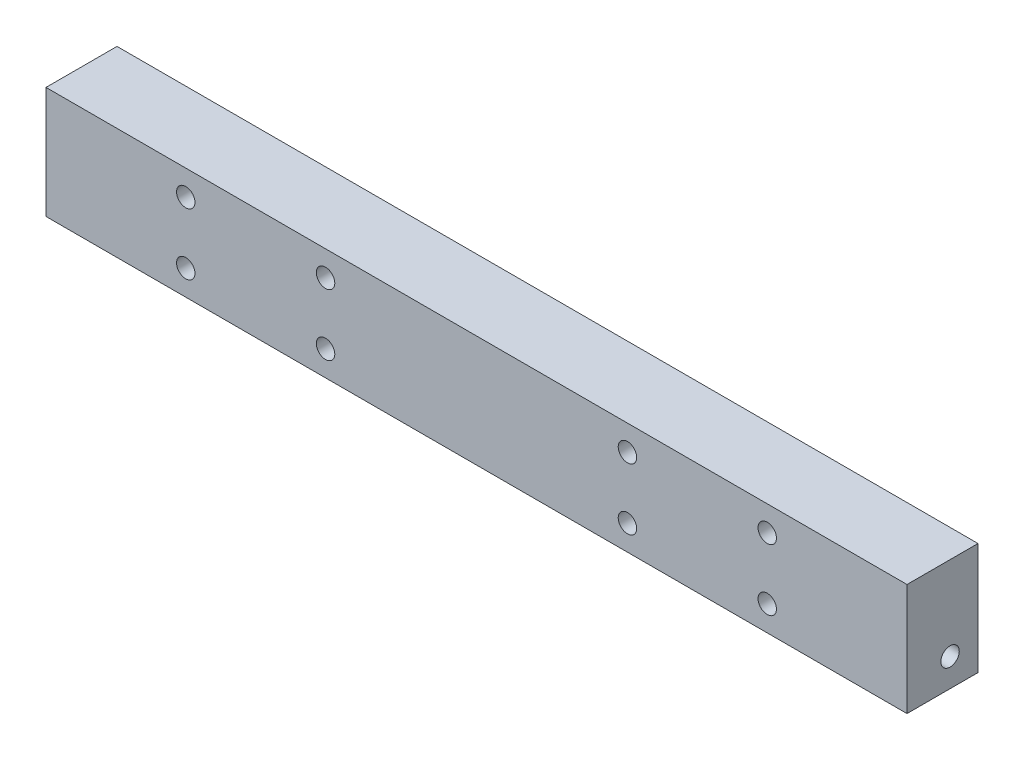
ISO-10303-21;
HEADER;
FILE_DESCRIPTION(('STEP AP214'),'2;1');
FILE_NAME('part.step','',(''),(''),'','','');
FILE_SCHEMA(('AUTOMOTIVE_DESIGN { 1 0 10303 214 1 1 1 1 }'));
ENDSEC;
DATA;
#1=APPLICATION_CONTEXT('core data for automotive mechanical design processes');
#2=APPLICATION_PROTOCOL_DEFINITION('international standard','automotive_design',2000,#1);
#3=PRODUCT_CONTEXT('',#1,'mechanical');
#4=PRODUCT('Part','Part','',(#3));
#5=PRODUCT_RELATED_PRODUCT_CATEGORY('part','',(#4));
#6=PRODUCT_DEFINITION_FORMATION('','',#4);
#7=PRODUCT_DEFINITION_CONTEXT('part definition',#1,'design');
#8=PRODUCT_DEFINITION('design','',#6,#7);
#9=PRODUCT_DEFINITION_SHAPE('','',#8);
#10=(LENGTH_UNIT() NAMED_UNIT(*) SI_UNIT(.MILLI.,.METRE.));
#11=(NAMED_UNIT(*) PLANE_ANGLE_UNIT() SI_UNIT($,.RADIAN.));
#12=(NAMED_UNIT(*) SI_UNIT($,.STERADIAN.) SOLID_ANGLE_UNIT());
#13=UNCERTAINTY_MEASURE_WITH_UNIT(LENGTH_MEASURE(1.E-05),#10,'distance_accuracy_value','');
#14=(GEOMETRIC_REPRESENTATION_CONTEXT(3) GLOBAL_UNCERTAINTY_ASSIGNED_CONTEXT((#13)) GLOBAL_UNIT_ASSIGNED_CONTEXT((#10,
#11,#12)) REPRESENTATION_CONTEXT('',''));
#15=CARTESIAN_POINT('',(0.,0.,0.));
#16=DIRECTION('',(0.,0.,1.));
#17=DIRECTION('',(1.,0.,0.));
#18=AXIS2_PLACEMENT_3D('',#15,#16,#17);
#19=CARTESIAN_POINT('',(77.,10.,12.7));
#20=DIRECTION('',(-1.,0.,0.));
#21=DIRECTION('',(0.,0.,1.));
#22=AXIS2_PLACEMENT_3D('',#19,#20,#21);
#23=PLANE('',#22);
#24=CARTESIAN_POINT('',(77.,-5.,5.));
#25=DIRECTION('',(1.,0.,0.));
#26=DIRECTION('',(0.,1.,0.));
#27=AXIS2_PLACEMENT_3D('',#24,#25,#26);
#28=CIRCLE('',#27,1.64999999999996);
#29=CARTESIAN_POINT('',(77.,-3.35000000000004,5.));
#30=VERTEX_POINT('',#29);
#31=EDGE_CURVE('E114',#30,#30,#28,.T.);
#32=ORIENTED_EDGE('',*,*,#31,.F.);
#33=EDGE_LOOP('',(#32));
#34=FACE_BOUND('',#33,.T.);
#35=DIRECTION('',(0.,1.,0.));
#36=VECTOR('',#35,1.);
#37=CARTESIAN_POINT('',(77.,10.,0.));
#38=LINE('',#37,#36);
#39=CARTESIAN_POINT('',(77.,-10.,0.));
#40=VERTEX_POINT('',#39);
#41=CARTESIAN_POINT('',(77.,10.,0.));
#42=VERTEX_POINT('',#41);
#43=EDGE_CURVE('E100',#40,#42,#38,.T.);
#44=ORIENTED_EDGE('',*,*,#43,.T.);
#45=DIRECTION('',(0.,0.,-1.));
#46=VECTOR('',#45,1.);
#47=CARTESIAN_POINT('',(77.,10.,12.7));
#48=LINE('',#47,#46);
#49=CARTESIAN_POINT('',(77.,10.,12.7));
#50=VERTEX_POINT('',#49);
#51=EDGE_CURVE('E11',#50,#42,#48,.T.);
#52=ORIENTED_EDGE('',*,*,#51,.F.);
#53=DIRECTION('',(0.,1.,0.));
#54=VECTOR('',#53,1.);
#55=CARTESIAN_POINT('',(77.,10.,12.7));
#56=LINE('',#55,#54);
#57=CARTESIAN_POINT('',(77.,-10.,12.7));
#58=VERTEX_POINT('',#57);
#59=EDGE_CURVE('E88',#58,#50,#56,.T.);
#60=ORIENTED_EDGE('',*,*,#59,.F.);
#61=DIRECTION('',(0.,0.,-1.));
#62=VECTOR('',#61,1.);
#63=CARTESIAN_POINT('',(77.,-10.,12.7));
#64=LINE('',#63,#62);
#65=EDGE_CURVE('E96',#58,#40,#64,.T.);
#66=ORIENTED_EDGE('',*,*,#65,.T.);
#67=EDGE_LOOP('',(#44,#52,#60,#66));
#68=FACE_BOUND('',#67,.T.);
#69=ADVANCED_FACE('F37',(#34,#68),#23,.F.);
#70=CARTESIAN_POINT('',(-77.,10.,12.7));
#71=DIRECTION('',(0.,-1.,0.));
#72=DIRECTION('',(0.,0.,-1.));
#73=AXIS2_PLACEMENT_3D('',#70,#71,#72);
#74=PLANE('',#73);
#75=DIRECTION('',(-1.,0.,0.));
#76=VECTOR('',#75,1.);
#77=CARTESIAN_POINT('',(-77.,10.,0.));
#78=LINE('',#77,#76);
#79=CARTESIAN_POINT('',(-77.,10.,0.));
#80=VERTEX_POINT('',#79);
#81=EDGE_CURVE('E92',#42,#80,#78,.T.);
#82=ORIENTED_EDGE('',*,*,#81,.T.);
#83=DIRECTION('',(0.,0.,-1.));
#84=VECTOR('',#83,1.);
#85=CARTESIAN_POINT('',(-77.,10.,12.7));
#86=LINE('',#85,#84);
#87=CARTESIAN_POINT('',(-77.,10.,12.7));
#88=VERTEX_POINT('',#87);
#89=EDGE_CURVE('E45',#88,#80,#86,.T.);
#90=ORIENTED_EDGE('',*,*,#89,.F.);
#91=DIRECTION('',(-1.,0.,0.));
#92=VECTOR('',#91,1.);
#93=CARTESIAN_POINT('',(-77.,10.,12.7));
#94=LINE('',#93,#92);
#95=EDGE_CURVE('E83',#50,#88,#94,.T.);
#96=ORIENTED_EDGE('',*,*,#95,.F.);
#97=ORIENTED_EDGE('',*,*,#51,.T.);
#98=EDGE_LOOP('',(#82,#90,#96,#97));
#99=FACE_BOUND('',#98,.T.);
#100=ADVANCED_FACE('F91',(#99),#74,.F.);
#101=CARTESIAN_POINT('',(-77.,10.,12.7));
#102=DIRECTION('',(1.,0.,0.));
#103=DIRECTION('',(0.,0.,-1.));
#104=AXIS2_PLACEMENT_3D('',#101,#102,#103);
#105=PLANE('',#104);
#106=CARTESIAN_POINT('',(-77.,-5.,5.));
#107=DIRECTION('',(1.,0.,0.));
#108=DIRECTION('',(0.,1.,0.));
#109=AXIS2_PLACEMENT_3D('',#106,#107,#108);
#110=CIRCLE('',#109,1.64999999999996);
#111=CARTESIAN_POINT('',(-77.,-3.35000000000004,5.));
#112=VERTEX_POINT('',#111);
#113=EDGE_CURVE('E144',#112,#112,#110,.T.);
#114=ORIENTED_EDGE('',*,*,#113,.T.);
#115=EDGE_LOOP('',(#114));
#116=FACE_BOUND('',#115,.T.);
#117=DIRECTION('',(0.,-1.,0.));
#118=VECTOR('',#117,1.);
#119=CARTESIAN_POINT('',(-77.,10.,0.));
#120=LINE('',#119,#118);
#121=CARTESIAN_POINT('',(-77.,-10.,0.));
#122=VERTEX_POINT('',#121);
#123=EDGE_CURVE('E70',#80,#122,#120,.T.);
#124=ORIENTED_EDGE('',*,*,#123,.T.);
#125=DIRECTION('',(0.,0.,-1.));
#126=VECTOR('',#125,1.);
#127=CARTESIAN_POINT('',(-77.,-10.,12.7));
#128=LINE('',#127,#126);
#129=CARTESIAN_POINT('',(-77.,-10.,12.7));
#130=VERTEX_POINT('',#129);
#131=EDGE_CURVE('E93',#130,#122,#128,.T.);
#132=ORIENTED_EDGE('',*,*,#131,.F.);
#133=DIRECTION('',(0.,-1.,0.));
#134=VECTOR('',#133,1.);
#135=CARTESIAN_POINT('',(-77.,10.,12.7));
#136=LINE('',#135,#134);
#137=EDGE_CURVE('E86',#88,#130,#136,.T.);
#138=ORIENTED_EDGE('',*,*,#137,.F.);
#139=ORIENTED_EDGE('',*,*,#89,.T.);
#140=EDGE_LOOP('',(#124,#132,#138,#139));
#141=FACE_BOUND('',#140,.T.);
#142=ADVANCED_FACE('F94',(#116,#141),#105,.F.);
#143=CARTESIAN_POINT('',(-77.,-10.,12.7));
#144=DIRECTION('',(0.,1.,0.));
#145=DIRECTION('',(0.,0.,1.));
#146=AXIS2_PLACEMENT_3D('',#143,#144,#145);
#147=PLANE('',#146);
#148=DIRECTION('',(1.,0.,0.));
#149=VECTOR('',#148,1.);
#150=CARTESIAN_POINT('',(-77.,-10.,0.));
#151=LINE('',#150,#149);
#152=EDGE_CURVE('E76',#122,#40,#151,.T.);
#153=ORIENTED_EDGE('',*,*,#152,.T.);
#154=ORIENTED_EDGE('',*,*,#65,.F.);
#155=DIRECTION('',(1.,0.,0.));
#156=VECTOR('',#155,1.);
#157=CARTESIAN_POINT('',(-77.,-10.,12.7));
#158=LINE('',#157,#156);
#159=EDGE_CURVE('E53',#130,#58,#158,.T.);
#160=ORIENTED_EDGE('',*,*,#159,.F.);
#161=ORIENTED_EDGE('',*,*,#131,.T.);
#162=EDGE_LOOP('',(#153,#154,#160,#161));
#163=FACE_BOUND('',#162,.T.);
#164=ADVANCED_FACE('F108',(#163),#147,.F.);
#165=CARTESIAN_POINT('',(0.,0.,12.7));
#166=DIRECTION('',(0.,0.,1.));
#167=DIRECTION('',(1.,0.,0.));
#168=AXIS2_PLACEMENT_3D('',#165,#166,#167);
#169=PLANE('',#168);
#170=CARTESIAN_POINT('',(-52.,-5.5,12.7));
#171=DIRECTION('',(0.,0.,-1.));
#172=DIRECTION('',(-1.,0.,0.));
#173=AXIS2_PLACEMENT_3D('',#170,#171,#172);
#174=CIRCLE('',#173,1.65);
#175=CARTESIAN_POINT('',(-53.65,-5.5,12.7));
#176=VERTEX_POINT('',#175);
#177=EDGE_CURVE('E163',#176,#176,#174,.T.);
#178=ORIENTED_EDGE('',*,*,#177,.T.);
#179=EDGE_LOOP('',(#178));
#180=FACE_BOUND('',#179,.T.);
#181=CARTESIAN_POINT('',(-27.,5.5,12.7));
#182=DIRECTION('',(0.,0.,-1.));
#183=DIRECTION('',(-1.,0.,0.));
#184=AXIS2_PLACEMENT_3D('',#181,#182,#183);
#185=CIRCLE('',#184,1.65);
#186=CARTESIAN_POINT('',(-28.65,5.5,12.7));
#187=VERTEX_POINT('',#186);
#188=EDGE_CURVE('E156',#187,#187,#185,.T.);
#189=ORIENTED_EDGE('',*,*,#188,.T.);
#190=EDGE_LOOP('',(#189));
#191=FACE_BOUND('',#190,.T.);
#192=CARTESIAN_POINT('',(-27.,-5.5,12.7));
#193=DIRECTION('',(0.,0.,-1.));
#194=DIRECTION('',(-1.,0.,0.));
#195=AXIS2_PLACEMENT_3D('',#192,#193,#194);
#196=CIRCLE('',#195,1.65);
#197=CARTESIAN_POINT('',(-28.65,-5.5,12.7));
#198=VERTEX_POINT('',#197);
#199=EDGE_CURVE('E168',#198,#198,#196,.T.);
#200=ORIENTED_EDGE('',*,*,#199,.T.);
#201=EDGE_LOOP('',(#200));
#202=FACE_BOUND('',#201,.T.);
#203=CARTESIAN_POINT('',(-52.,5.5,12.7));
#204=DIRECTION('',(0.,0.,-1.));
#205=DIRECTION('',(-1.,0.,0.));
#206=AXIS2_PLACEMENT_3D('',#203,#204,#205);
#207=CIRCLE('',#206,1.65);
#208=CARTESIAN_POINT('',(-53.65,5.5,12.7));
#209=VERTEX_POINT('',#208);
#210=EDGE_CURVE('E150',#209,#209,#207,.T.);
#211=ORIENTED_EDGE('',*,*,#210,.T.);
#212=EDGE_LOOP('',(#211));
#213=FACE_BOUND('',#212,.T.);
#214=CARTESIAN_POINT('',(52.,-5.5,12.7));
#215=DIRECTION('',(0.,0.,1.));
#216=DIRECTION('',(1.,0.,0.));
#217=AXIS2_PLACEMENT_3D('',#214,#215,#216);
#218=CIRCLE('',#217,1.65);
#219=CARTESIAN_POINT('',(53.65,-5.5,12.7));
#220=VERTEX_POINT('',#219);
#221=EDGE_CURVE('E133',#220,#220,#218,.T.);
#222=ORIENTED_EDGE('',*,*,#221,.F.);
#223=EDGE_LOOP('',(#222));
#224=FACE_BOUND('',#223,.T.);
#225=CARTESIAN_POINT('',(27.,5.5,12.7));
#226=DIRECTION('',(0.,0.,1.));
#227=DIRECTION('',(1.,0.,0.));
#228=AXIS2_PLACEMENT_3D('',#225,#226,#227);
#229=CIRCLE('',#228,1.65);
#230=CARTESIAN_POINT('',(28.65,5.5,12.7));
#231=VERTEX_POINT('',#230);
#232=EDGE_CURVE('E126',#231,#231,#229,.T.);
#233=ORIENTED_EDGE('',*,*,#232,.F.);
#234=EDGE_LOOP('',(#233));
#235=FACE_BOUND('',#234,.T.);
#236=CARTESIAN_POINT('',(27.,-5.5,12.7));
#237=DIRECTION('',(0.,0.,1.));
#238=DIRECTION('',(1.,0.,0.));
#239=AXIS2_PLACEMENT_3D('',#236,#237,#238);
#240=CIRCLE('',#239,1.65);
#241=CARTESIAN_POINT('',(28.65,-5.5,12.7));
#242=VERTEX_POINT('',#241);
#243=EDGE_CURVE('E138',#242,#242,#240,.T.);
#244=ORIENTED_EDGE('',*,*,#243,.F.);
#245=EDGE_LOOP('',(#244));
#246=FACE_BOUND('',#245,.T.);
#247=CARTESIAN_POINT('',(52.,5.5,12.7));
#248=DIRECTION('',(0.,0.,1.));
#249=DIRECTION('',(1.,0.,0.));
#250=AXIS2_PLACEMENT_3D('',#247,#248,#249);
#251=CIRCLE('',#250,1.65);
#252=CARTESIAN_POINT('',(53.65,5.5,12.7));
#253=VERTEX_POINT('',#252);
#254=EDGE_CURVE('E120',#253,#253,#251,.T.);
#255=ORIENTED_EDGE('',*,*,#254,.F.);
#256=EDGE_LOOP('',(#255));
#257=FACE_BOUND('',#256,.T.);
#258=ORIENTED_EDGE('',*,*,#59,.T.);
#259=ORIENTED_EDGE('',*,*,#95,.T.);
#260=ORIENTED_EDGE('',*,*,#137,.T.);
#261=ORIENTED_EDGE('',*,*,#159,.T.);
#262=EDGE_LOOP('',(#258,#259,#260,#261));
#263=FACE_BOUND('',#262,.T.);
#264=ADVANCED_FACE('F84',(#180,#191,#202,#213,#224,#235,#246,#257,#263),#169,.T.);
#265=CARTESIAN_POINT('',(0.,0.,0.));
#266=DIRECTION('',(0.,0.,1.));
#267=DIRECTION('',(1.,0.,0.));
#268=AXIS2_PLACEMENT_3D('',#265,#266,#267);
#269=PLANE('',#268);
#270=CARTESIAN_POINT('',(-52.,-5.5,0.));
#271=DIRECTION('',(0.,0.,-1.));
#272=DIRECTION('',(-1.,0.,0.));
#273=AXIS2_PLACEMENT_3D('',#270,#271,#272);
#274=CIRCLE('',#273,1.65);
#275=CARTESIAN_POINT('',(-53.65,-5.5,0.));
#276=VERTEX_POINT('',#275);
#277=EDGE_CURVE('E153',#276,#276,#274,.T.);
#278=ORIENTED_EDGE('',*,*,#277,.F.);
#279=EDGE_LOOP('',(#278));
#280=FACE_BOUND('',#279,.T.);
#281=CARTESIAN_POINT('',(-27.,5.5,0.));
#282=DIRECTION('',(0.,0.,-1.));
#283=DIRECTION('',(-1.,0.,0.));
#284=AXIS2_PLACEMENT_3D('',#281,#282,#283);
#285=CIRCLE('',#284,1.65);
#286=CARTESIAN_POINT('',(-28.65,5.5,0.));
#287=VERTEX_POINT('',#286);
#288=EDGE_CURVE('E159',#287,#287,#285,.T.);
#289=ORIENTED_EDGE('',*,*,#288,.F.);
#290=EDGE_LOOP('',(#289));
#291=FACE_BOUND('',#290,.T.);
#292=CARTESIAN_POINT('',(-27.,-5.5,0.));
#293=DIRECTION('',(0.,0.,-1.));
#294=DIRECTION('',(-1.,0.,0.));
#295=AXIS2_PLACEMENT_3D('',#292,#293,#294);
#296=CIRCLE('',#295,1.65);
#297=CARTESIAN_POINT('',(-28.65,-5.5,0.));
#298=VERTEX_POINT('',#297);
#299=EDGE_CURVE('E160',#298,#298,#296,.T.);
#300=ORIENTED_EDGE('',*,*,#299,.F.);
#301=EDGE_LOOP('',(#300));
#302=FACE_BOUND('',#301,.T.);
#303=CARTESIAN_POINT('',(-52.,5.5,0.));
#304=DIRECTION('',(0.,0.,-1.));
#305=DIRECTION('',(-1.,0.,0.));
#306=AXIS2_PLACEMENT_3D('',#303,#304,#305);
#307=CIRCLE('',#306,1.65);
#308=CARTESIAN_POINT('',(-53.65,5.5,0.));
#309=VERTEX_POINT('',#308);
#310=EDGE_CURVE('E147',#309,#309,#307,.T.);
#311=ORIENTED_EDGE('',*,*,#310,.F.);
#312=EDGE_LOOP('',(#311));
#313=FACE_BOUND('',#312,.T.);
#314=CARTESIAN_POINT('',(52.,-5.5,0.));
#315=DIRECTION('',(0.,0.,1.));
#316=DIRECTION('',(1.,0.,0.));
#317=AXIS2_PLACEMENT_3D('',#314,#315,#316);
#318=CIRCLE('',#317,1.65);
#319=CARTESIAN_POINT('',(53.65,-5.5,0.));
#320=VERTEX_POINT('',#319);
#321=EDGE_CURVE('E123',#320,#320,#318,.T.);
#322=ORIENTED_EDGE('',*,*,#321,.T.);
#323=EDGE_LOOP('',(#322));
#324=FACE_BOUND('',#323,.T.);
#325=CARTESIAN_POINT('',(27.,5.5,0.));
#326=DIRECTION('',(0.,0.,1.));
#327=DIRECTION('',(1.,0.,0.));
#328=AXIS2_PLACEMENT_3D('',#325,#326,#327);
#329=CIRCLE('',#328,1.65);
#330=CARTESIAN_POINT('',(28.65,5.5,0.));
#331=VERTEX_POINT('',#330);
#332=EDGE_CURVE('E129',#331,#331,#329,.T.);
#333=ORIENTED_EDGE('',*,*,#332,.T.);
#334=EDGE_LOOP('',(#333));
#335=FACE_BOUND('',#334,.T.);
#336=CARTESIAN_POINT('',(27.,-5.5,0.));
#337=DIRECTION('',(0.,0.,1.));
#338=DIRECTION('',(1.,0.,0.));
#339=AXIS2_PLACEMENT_3D('',#336,#337,#338);
#340=CIRCLE('',#339,1.65);
#341=CARTESIAN_POINT('',(28.65,-5.5,0.));
#342=VERTEX_POINT('',#341);
#343=EDGE_CURVE('E130',#342,#342,#340,.T.);
#344=ORIENTED_EDGE('',*,*,#343,.T.);
#345=EDGE_LOOP('',(#344));
#346=FACE_BOUND('',#345,.T.);
#347=CARTESIAN_POINT('',(52.,5.5,0.));
#348=DIRECTION('',(0.,0.,1.));
#349=DIRECTION('',(1.,0.,0.));
#350=AXIS2_PLACEMENT_3D('',#347,#348,#349);
#351=CIRCLE('',#350,1.65);
#352=CARTESIAN_POINT('',(53.65,5.5,0.));
#353=VERTEX_POINT('',#352);
#354=EDGE_CURVE('E117',#353,#353,#351,.T.);
#355=ORIENTED_EDGE('',*,*,#354,.T.);
#356=EDGE_LOOP('',(#355));
#357=FACE_BOUND('',#356,.T.);
#358=ORIENTED_EDGE('',*,*,#43,.F.);
#359=ORIENTED_EDGE('',*,*,#152,.F.);
#360=ORIENTED_EDGE('',*,*,#123,.F.);
#361=ORIENTED_EDGE('',*,*,#81,.F.);
#362=EDGE_LOOP('',(#358,#359,#360,#361));
#363=FACE_BOUND('',#362,.T.);
#364=ADVANCED_FACE('F111',(#280,#291,#302,#313,#324,#335,#346,#357,#363),#269,.F.);
#365=CARTESIAN_POINT('',(55.,-5.,5.));
#366=DIRECTION('',(1.,0.,0.));
#367=DIRECTION('',(0.,1.,0.));
#368=AXIS2_PLACEMENT_3D('',#365,#366,#367);
#369=CYLINDRICAL_SURFACE('',#368,1.64999999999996);
#370=CARTESIAN_POINT('',(55.,-5.,5.));
#371=DIRECTION('',(1.,0.,0.));
#372=DIRECTION('',(0.,1.,0.));
#373=AXIS2_PLACEMENT_3D('',#370,#371,#372);
#374=CIRCLE('',#373,1.64999999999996);
#375=CARTESIAN_POINT('',(55.,-3.35000000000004,5.));
#376=VERTEX_POINT('',#375);
#377=EDGE_CURVE('E103',#376,#376,#374,.T.);
#378=ORIENTED_EDGE('',*,*,#377,.F.);
#379=EDGE_LOOP('',(#378));
#380=FACE_BOUND('',#379,.T.);
#381=ORIENTED_EDGE('',*,*,#31,.T.);
#382=EDGE_LOOP('',(#381));
#383=FACE_BOUND('',#382,.T.);
#384=ADVANCED_FACE('F179',(#380,#383),#369,.F.);
#385=CARTESIAN_POINT('',(55.,-5.,5.));
#386=DIRECTION('',(1.,0.,0.));
#387=DIRECTION('',(0.,1.,0.));
#388=AXIS2_PLACEMENT_3D('',#385,#386,#387);
#389=PLANE('',#388);
#390=ORIENTED_EDGE('',*,*,#377,.T.);
#391=EDGE_LOOP('',(#390));
#392=FACE_BOUND('',#391,.T.);
#393=ADVANCED_FACE('F196',(#392),#389,.T.);
#394=CARTESIAN_POINT('',(52.,5.5,0.));
#395=DIRECTION('',(0.,0.,1.));
#396=DIRECTION('',(1.,0.,0.));
#397=AXIS2_PLACEMENT_3D('',#394,#395,#396);
#398=CYLINDRICAL_SURFACE('',#397,1.65);
#399=ORIENTED_EDGE('',*,*,#354,.F.);
#400=EDGE_LOOP('',(#399));
#401=FACE_BOUND('',#400,.T.);
#402=ORIENTED_EDGE('',*,*,#254,.T.);
#403=EDGE_LOOP('',(#402));
#404=FACE_BOUND('',#403,.T.);
#405=ADVANCED_FACE('F192',(#401,#404),#398,.F.);
#406=CARTESIAN_POINT('',(27.,-5.5,0.));
#407=DIRECTION('',(0.,0.,1.));
#408=DIRECTION('',(1.,0.,0.));
#409=AXIS2_PLACEMENT_3D('',#406,#407,#408);
#410=CYLINDRICAL_SURFACE('',#409,1.65);
#411=ORIENTED_EDGE('',*,*,#343,.F.);
#412=EDGE_LOOP('',(#411));
#413=FACE_BOUND('',#412,.T.);
#414=ORIENTED_EDGE('',*,*,#243,.T.);
#415=EDGE_LOOP('',(#414));
#416=FACE_BOUND('',#415,.T.);
#417=ADVANCED_FACE('F195',(#413,#416),#410,.F.);
#418=CARTESIAN_POINT('',(27.,5.5,0.));
#419=DIRECTION('',(0.,0.,1.));
#420=DIRECTION('',(1.,0.,0.));
#421=AXIS2_PLACEMENT_3D('',#418,#419,#420);
#422=CYLINDRICAL_SURFACE('',#421,1.65);
#423=ORIENTED_EDGE('',*,*,#332,.F.);
#424=EDGE_LOOP('',(#423));
#425=FACE_BOUND('',#424,.T.);
#426=ORIENTED_EDGE('',*,*,#232,.T.);
#427=EDGE_LOOP('',(#426));
#428=FACE_BOUND('',#427,.T.);
#429=ADVANCED_FACE('F225',(#425,#428),#422,.F.);
#430=CARTESIAN_POINT('',(52.,-5.5,0.));
#431=DIRECTION('',(0.,0.,1.));
#432=DIRECTION('',(1.,0.,0.));
#433=AXIS2_PLACEMENT_3D('',#430,#431,#432);
#434=CYLINDRICAL_SURFACE('',#433,1.65);
#435=ORIENTED_EDGE('',*,*,#321,.F.);
#436=EDGE_LOOP('',(#435));
#437=FACE_BOUND('',#436,.T.);
#438=ORIENTED_EDGE('',*,*,#221,.T.);
#439=EDGE_LOOP('',(#438));
#440=FACE_BOUND('',#439,.T.);
#441=ADVANCED_FACE('F228',(#437,#440),#434,.F.);
#442=CARTESIAN_POINT('',(-55.,-5.,5.));
#443=DIRECTION('',(-1.,0.,0.));
#444=DIRECTION('',(0.,-1.,0.));
#445=AXIS2_PLACEMENT_3D('',#442,#443,#444);
#446=CYLINDRICAL_SURFACE('',#445,1.64999999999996);
#447=CARTESIAN_POINT('',(-55.,-5.,5.));
#448=DIRECTION('',(1.,0.,0.));
#449=DIRECTION('',(0.,1.,0.));
#450=AXIS2_PLACEMENT_3D('',#447,#448,#449);
#451=CIRCLE('',#450,1.64999999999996);
#452=CARTESIAN_POINT('',(-55.,-3.35000000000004,5.));
#453=VERTEX_POINT('',#452);
#454=EDGE_CURVE('E141',#453,#453,#451,.T.);
#455=ORIENTED_EDGE('',*,*,#454,.T.);
#456=EDGE_LOOP('',(#455));
#457=FACE_BOUND('',#456,.T.);
#458=ORIENTED_EDGE('',*,*,#113,.F.);
#459=EDGE_LOOP('',(#458));
#460=FACE_BOUND('',#459,.T.);
#461=ADVANCED_FACE('F232',(#457,#460),#446,.F.);
#462=CARTESIAN_POINT('',(-55.,-5.,5.));
#463=DIRECTION('',(-1.,0.,0.));
#464=DIRECTION('',(0.,1.,0.));
#465=AXIS2_PLACEMENT_3D('',#462,#463,#464);
#466=PLANE('',#465);
#467=ORIENTED_EDGE('',*,*,#454,.F.);
#468=EDGE_LOOP('',(#467));
#469=FACE_BOUND('',#468,.T.);
#470=ADVANCED_FACE('F239',(#469),#466,.T.);
#471=CARTESIAN_POINT('',(-52.,5.5,0.));
#472=DIRECTION('',(0.,0.,1.));
#473=DIRECTION('',(1.,0.,0.));
#474=AXIS2_PLACEMENT_3D('',#471,#472,#473);
#475=CYLINDRICAL_SURFACE('',#474,1.65);
#476=ORIENTED_EDGE('',*,*,#310,.T.);
#477=EDGE_LOOP('',(#476));
#478=FACE_BOUND('',#477,.T.);
#479=ORIENTED_EDGE('',*,*,#210,.F.);
#480=EDGE_LOOP('',(#479));
#481=FACE_BOUND('',#480,.T.);
#482=ADVANCED_FACE('F243',(#478,#481),#475,.F.);
#483=CARTESIAN_POINT('',(-27.,-5.5,0.));
#484=DIRECTION('',(0.,0.,1.));
#485=DIRECTION('',(1.,0.,0.));
#486=AXIS2_PLACEMENT_3D('',#483,#484,#485);
#487=CYLINDRICAL_SURFACE('',#486,1.65);
#488=ORIENTED_EDGE('',*,*,#299,.T.);
#489=EDGE_LOOP('',(#488));
#490=FACE_BOUND('',#489,.T.);
#491=ORIENTED_EDGE('',*,*,#199,.F.);
#492=EDGE_LOOP('',(#491));
#493=FACE_BOUND('',#492,.T.);
#494=ADVANCED_FACE('F174',(#490,#493),#487,.F.);
#495=CARTESIAN_POINT('',(-27.,5.5,0.));
#496=DIRECTION('',(0.,0.,1.));
#497=DIRECTION('',(1.,0.,0.));
#498=AXIS2_PLACEMENT_3D('',#495,#496,#497);
#499=CYLINDRICAL_SURFACE('',#498,1.65);
#500=ORIENTED_EDGE('',*,*,#288,.T.);
#501=EDGE_LOOP('',(#500));
#502=FACE_BOUND('',#501,.T.);
#503=ORIENTED_EDGE('',*,*,#188,.F.);
#504=EDGE_LOOP('',(#503));
#505=FACE_BOUND('',#504,.T.);
#506=ADVANCED_FACE('F248',(#502,#505),#499,.F.);
#507=CARTESIAN_POINT('',(-52.,-5.5,0.));
#508=DIRECTION('',(0.,0.,1.));
#509=DIRECTION('',(1.,0.,0.));
#510=AXIS2_PLACEMENT_3D('',#507,#508,#509);
#511=CYLINDRICAL_SURFACE('',#510,1.65);
#512=ORIENTED_EDGE('',*,*,#277,.T.);
#513=EDGE_LOOP('',(#512));
#514=FACE_BOUND('',#513,.T.);
#515=ORIENTED_EDGE('',*,*,#177,.F.);
#516=EDGE_LOOP('',(#515));
#517=FACE_BOUND('',#516,.T.);
#518=ADVANCED_FACE('F251',(#514,#517),#511,.F.);
#519=CLOSED_SHELL('',(#69,#100,#142,#164,#264,#364,#384,#393,#405,#417,#429,#441,#461,#470,#482,
#494,#506,#518));
#520=MANIFOLD_SOLID_BREP('B2',#519);
#521=ADVANCED_BREP_SHAPE_REPRESENTATION('',(#18,#520),#14);
#522=SHAPE_DEFINITION_REPRESENTATION(#9,#521);
ENDSEC;
END-ISO-10303-21;
